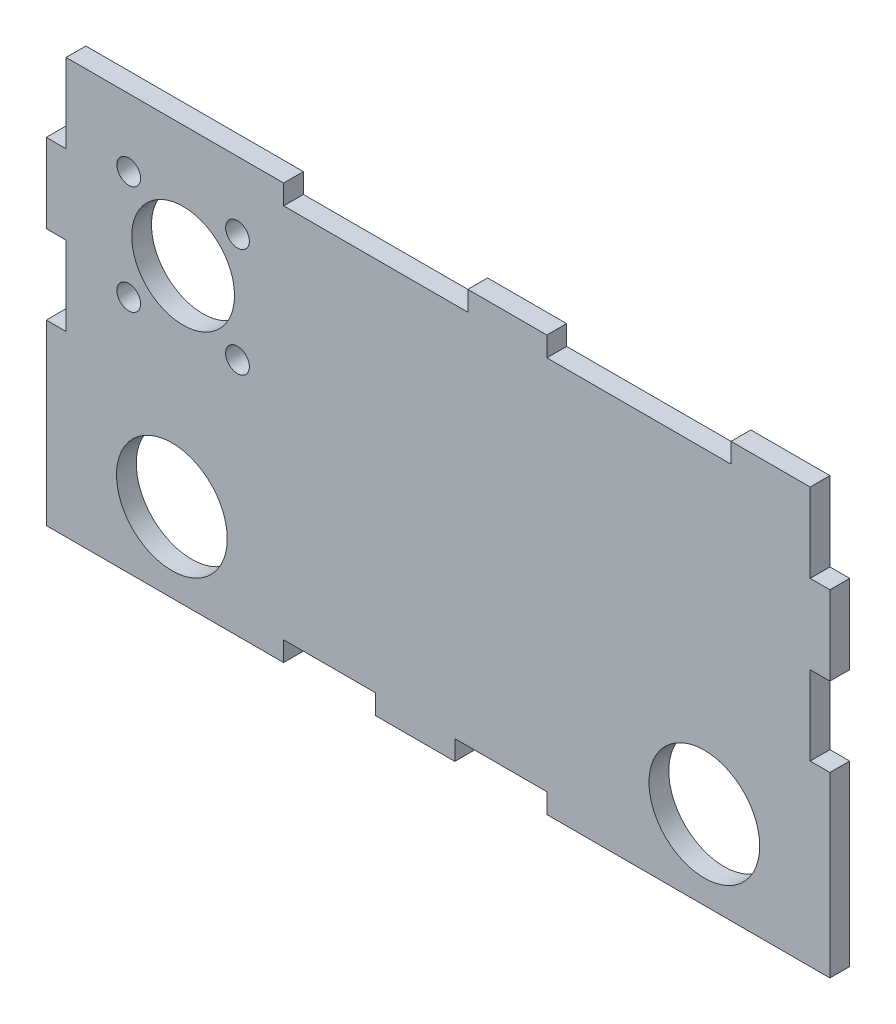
from build123d import *

# Parameters (mm, degrees)
SKETCH1_R           = 14
SKETCH1_R_2         = 3
SKETCH1_R_3         = 13
BOSS_EXTRUDE1_DEPTH = 5


with BuildPart() as part:
    # Sketch1 → Boss-Extrude1 (new body)
    with BuildSketch(Plane.XY):
        Polygon((0, 0), (0, 45), (5, 45), (5, 65), (0, 65), (0, 85), (5, 85), (5, 105), (60, 105), (60, 100), (106.56, 100), (106.56, 105), (126.56, 105), (126.56, 100), (173.12, 100), (173.12, 105), (193.12, 105), (193.12, 85), (198.12, 85), (198.12, 65), (193.12, 65), (193.12, 45), (198.12, 45), (198.12, 0), (126.56, 0), (126.56, 5), (103.28, 5), (103.28, 0), (83.28, 0), (83.28, 5), (60, 5), (60, 0), align=None)
        with Locations((31.75, 20)):
            Circle(SKETCH1_R, mode=Mode.SUBTRACT)
        with Locations((166.37, 20)):
            Circle(SKETCH1_R, mode=Mode.SUBTRACT)
        with Locations((20.842227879, 87.924331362)):
            Circle(SKETCH1_R_2, mode=Mode.SUBTRACT)
        with Locations((20.842227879, 60.426787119)):
            Circle(SKETCH1_R_2, mode=Mode.SUBTRACT)
        with Locations((48.339772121, 60.426787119)):
            Circle(SKETCH1_R_2, mode=Mode.SUBTRACT)
        with Locations((48.339772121, 87.924331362)):
            Circle(SKETCH1_R_2, mode=Mode.SUBTRACT)
        with Locations((34.591, 74.17555924)):
            Circle(SKETCH1_R_3, mode=Mode.SUBTRACT)
    extrude(amount=BOSS_EXTRUDE1_DEPTH)


solid = part.part
